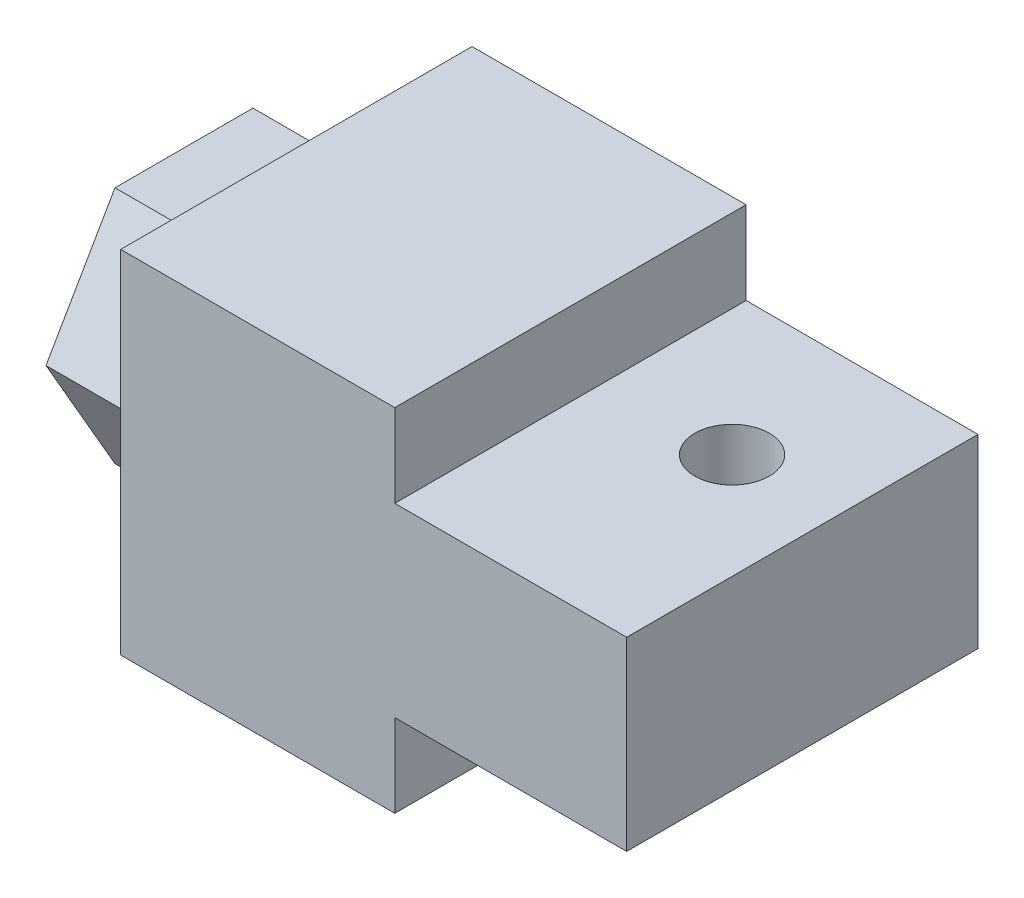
ISO-10303-21;
HEADER;
FILE_DESCRIPTION(('STEP AP214'),'2;1');
FILE_NAME('part.step','',(''),(''),'','','');
FILE_SCHEMA(('AUTOMOTIVE_DESIGN { 1 0 10303 214 1 1 1 1 }'));
ENDSEC;
DATA;
#1=APPLICATION_CONTEXT('core data for automotive mechanical design processes');
#2=APPLICATION_PROTOCOL_DEFINITION('international standard','automotive_design',2000,#1);
#3=PRODUCT_CONTEXT('',#1,'mechanical');
#4=PRODUCT('Part','Part','',(#3));
#5=PRODUCT_RELATED_PRODUCT_CATEGORY('part','',(#4));
#6=PRODUCT_DEFINITION_FORMATION('','',#4);
#7=PRODUCT_DEFINITION_CONTEXT('part definition',#1,'design');
#8=PRODUCT_DEFINITION('design','',#6,#7);
#9=PRODUCT_DEFINITION_SHAPE('','',#8);
#10=(LENGTH_UNIT() NAMED_UNIT(*) SI_UNIT(.MILLI.,.METRE.));
#11=(NAMED_UNIT(*) PLANE_ANGLE_UNIT() SI_UNIT($,.RADIAN.));
#12=(NAMED_UNIT(*) SI_UNIT($,.STERADIAN.) SOLID_ANGLE_UNIT());
#13=UNCERTAINTY_MEASURE_WITH_UNIT(LENGTH_MEASURE(1.E-05),#10,'distance_accuracy_value','');
#14=(GEOMETRIC_REPRESENTATION_CONTEXT(3) GLOBAL_UNCERTAINTY_ASSIGNED_CONTEXT((#13)) GLOBAL_UNIT_ASSIGNED_CONTEXT((#10,
#11,#12)) REPRESENTATION_CONTEXT('',''));
#15=CARTESIAN_POINT('',(0.,0.,0.));
#16=DIRECTION('',(0.,0.,1.));
#17=DIRECTION('',(1.,0.,0.));
#18=AXIS2_PLACEMENT_3D('',#15,#16,#17);
#19=CARTESIAN_POINT('',(36.,12.5,12.5));
#20=DIRECTION('',(0.,1.,0.));
#21=DIRECTION('',(0.,0.,-1.));
#22=AXIS2_PLACEMENT_3D('',#19,#20,#21);
#23=PLANE('',#22);
#24=DIRECTION('',(-1.,0.,0.));
#25=VECTOR('',#24,1.);
#26=CARTESIAN_POINT('',(36.,12.5,12.5));
#27=LINE('',#26,#25);
#28=CARTESIAN_POINT('',(19.5,12.5,12.5));
#29=VERTEX_POINT('',#28);
#30=CARTESIAN_POINT('',(0.,12.5,12.5));
#31=VERTEX_POINT('',#30);
#32=EDGE_CURVE('E23',#29,#31,#27,.T.);
#33=ORIENTED_EDGE('',*,*,#32,.F.);
#34=DIRECTION('',(0.,0.,-1.));
#35=VECTOR('',#34,1.);
#36=CARTESIAN_POINT('',(19.5,12.5,12.5));
#37=LINE('',#36,#35);
#38=CARTESIAN_POINT('',(19.5,12.5,-12.5));
#39=VERTEX_POINT('',#38);
#40=EDGE_CURVE('E193',#29,#39,#37,.T.);
#41=ORIENTED_EDGE('',*,*,#40,.T.);
#42=DIRECTION('',(-1.,0.,0.));
#43=VECTOR('',#42,1.);
#44=CARTESIAN_POINT('',(36.,12.5,-12.5));
#45=LINE('',#44,#43);
#46=CARTESIAN_POINT('',(0.,12.5,-12.5));
#47=VERTEX_POINT('',#46);
#48=EDGE_CURVE('E227',#39,#47,#45,.T.);
#49=ORIENTED_EDGE('',*,*,#48,.T.);
#50=DIRECTION('',(0.,0.,-1.));
#51=VECTOR('',#50,1.);
#52=CARTESIAN_POINT('',(0.,12.5,12.5));
#53=LINE('',#52,#51);
#54=EDGE_CURVE('E210',#31,#47,#53,.T.);
#55=ORIENTED_EDGE('',*,*,#54,.F.);
#56=EDGE_LOOP('',(#33,#41,#49,#55));
#57=FACE_BOUND('',#56,.T.);
#58=ADVANCED_FACE('F14',(#57),#23,.T.);
#59=CARTESIAN_POINT('',(36.,12.5,12.5));
#60=DIRECTION('',(0.,0.,-1.));
#61=DIRECTION('',(0.,-1.,0.));
#62=AXIS2_PLACEMENT_3D('',#59,#60,#61);
#63=PLANE('',#62);
#64=DIRECTION('',(0.,1.,0.));
#65=VECTOR('',#64,1.);
#66=CARTESIAN_POINT('',(19.5,6.6,12.5));
#67=LINE('',#66,#65);
#68=CARTESIAN_POINT('',(19.5,6.6,12.5));
#69=VERTEX_POINT('',#68);
#70=EDGE_CURVE('E181',#69,#29,#67,.T.);
#71=ORIENTED_EDGE('',*,*,#70,.T.);
#72=ORIENTED_EDGE('',*,*,#32,.T.);
#73=DIRECTION('',(0.,-1.,0.));
#74=VECTOR('',#73,1.);
#75=CARTESIAN_POINT('',(0.,12.5,12.5));
#76=LINE('',#75,#74);
#77=CARTESIAN_POINT('',(0.,-12.5,12.5));
#78=VERTEX_POINT('',#77);
#79=EDGE_CURVE('E219',#31,#78,#76,.T.);
#80=ORIENTED_EDGE('',*,*,#79,.T.);
#81=DIRECTION('',(-1.,0.,0.));
#82=VECTOR('',#81,1.);
#83=CARTESIAN_POINT('',(36.,-12.5,12.5));
#84=LINE('',#83,#82);
#85=CARTESIAN_POINT('',(19.5,-12.5,12.5));
#86=VERTEX_POINT('',#85);
#87=EDGE_CURVE('E231',#86,#78,#84,.T.);
#88=ORIENTED_EDGE('',*,*,#87,.F.);
#89=DIRECTION('',(0.,-1.,0.));
#90=VECTOR('',#89,1.);
#91=CARTESIAN_POINT('',(19.5,-6.6,12.5));
#92=LINE('',#91,#90);
#93=CARTESIAN_POINT('',(19.5,-6.6,12.5));
#94=VERTEX_POINT('',#93);
#95=EDGE_CURVE('E196',#94,#86,#92,.T.);
#96=ORIENTED_EDGE('',*,*,#95,.F.);
#97=DIRECTION('',(1.,0.,0.));
#98=VECTOR('',#97,1.);
#99=CARTESIAN_POINT('',(19.5,-6.6,12.5));
#100=LINE('',#99,#98);
#101=CARTESIAN_POINT('',(36.,-6.6,12.5));
#102=VERTEX_POINT('',#101);
#103=EDGE_CURVE('E198',#94,#102,#100,.T.);
#104=ORIENTED_EDGE('',*,*,#103,.T.);
#105=DIRECTION('',(0.,-1.,0.));
#106=VECTOR('',#105,1.);
#107=CARTESIAN_POINT('',(36.,12.5,12.5));
#108=LINE('',#107,#106);
#109=CARTESIAN_POINT('',(36.,6.6,12.5));
#110=VERTEX_POINT('',#109);
#111=EDGE_CURVE('E225',#110,#102,#108,.T.);
#112=ORIENTED_EDGE('',*,*,#111,.F.);
#113=DIRECTION('',(1.,0.,0.));
#114=VECTOR('',#113,1.);
#115=CARTESIAN_POINT('',(19.5,6.6,12.5));
#116=LINE('',#115,#114);
#117=EDGE_CURVE('E184',#69,#110,#116,.T.);
#118=ORIENTED_EDGE('',*,*,#117,.F.);
#119=EDGE_LOOP('',(#71,#72,#80,#88,#96,#104,#112,#118));
#120=FACE_BOUND('',#119,.T.);
#121=ADVANCED_FACE('F16',(#120),#63,.F.);
#122=CARTESIAN_POINT('',(36.,-12.5,-12.5));
#123=DIRECTION('',(0.,0.,1.));
#124=DIRECTION('',(0.,1.,0.));
#125=AXIS2_PLACEMENT_3D('',#122,#123,#124);
#126=PLANE('',#125);
#127=DIRECTION('',(0.,1.,0.));
#128=VECTOR('',#127,1.);
#129=CARTESIAN_POINT('',(19.5,6.6,-12.5));
#130=LINE('',#129,#128);
#131=CARTESIAN_POINT('',(19.5,6.6,-12.5));
#132=VERTEX_POINT('',#131);
#133=EDGE_CURVE('E186',#132,#39,#130,.T.);
#134=ORIENTED_EDGE('',*,*,#133,.F.);
#135=DIRECTION('',(1.,0.,0.));
#136=VECTOR('',#135,1.);
#137=CARTESIAN_POINT('',(19.5,6.6,-12.5));
#138=LINE('',#137,#136);
#139=CARTESIAN_POINT('',(36.,6.6,-12.5));
#140=VERTEX_POINT('',#139);
#141=EDGE_CURVE('E188',#132,#140,#138,.T.);
#142=ORIENTED_EDGE('',*,*,#141,.T.);
#143=DIRECTION('',(0.,1.,0.));
#144=VECTOR('',#143,1.);
#145=CARTESIAN_POINT('',(36.,-12.5,-12.5));
#146=LINE('',#145,#144);
#147=CARTESIAN_POINT('',(36.,-6.6,-12.5));
#148=VERTEX_POINT('',#147);
#149=EDGE_CURVE('E222',#148,#140,#146,.T.);
#150=ORIENTED_EDGE('',*,*,#149,.F.);
#151=DIRECTION('',(1.,0.,0.));
#152=VECTOR('',#151,1.);
#153=CARTESIAN_POINT('',(19.5,-6.6,-12.5));
#154=LINE('',#153,#152);
#155=CARTESIAN_POINT('',(19.5,-6.6,-12.5));
#156=VERTEX_POINT('',#155);
#157=EDGE_CURVE('E204',#156,#148,#154,.T.);
#158=ORIENTED_EDGE('',*,*,#157,.F.);
#159=DIRECTION('',(0.,-1.,0.));
#160=VECTOR('',#159,1.);
#161=CARTESIAN_POINT('',(19.5,-6.6,-12.5));
#162=LINE('',#161,#160);
#163=CARTESIAN_POINT('',(19.5,-12.5,-12.5));
#164=VERTEX_POINT('',#163);
#165=EDGE_CURVE('E201',#156,#164,#162,.T.);
#166=ORIENTED_EDGE('',*,*,#165,.T.);
#167=DIRECTION('',(-1.,0.,0.));
#168=VECTOR('',#167,1.);
#169=CARTESIAN_POINT('',(36.,-12.5,-12.5));
#170=LINE('',#169,#168);
#171=CARTESIAN_POINT('',(0.,-12.5,-12.5));
#172=VERTEX_POINT('',#171);
#173=EDGE_CURVE('E229',#164,#172,#170,.T.);
#174=ORIENTED_EDGE('',*,*,#173,.T.);
#175=DIRECTION('',(0.,1.,0.));
#176=VECTOR('',#175,1.);
#177=CARTESIAN_POINT('',(0.,-12.5,-12.5));
#178=LINE('',#177,#176);
#179=EDGE_CURVE('E213',#172,#47,#178,.T.);
#180=ORIENTED_EDGE('',*,*,#179,.T.);
#181=ORIENTED_EDGE('',*,*,#48,.F.);
#182=EDGE_LOOP('',(#134,#142,#150,#158,#166,#174,#180,#181));
#183=FACE_BOUND('',#182,.T.);
#184=ADVANCED_FACE('F263',(#183),#126,.F.);
#185=CARTESIAN_POINT('',(36.,12.5,-12.5));
#186=DIRECTION('',(1.,0.,0.));
#187=DIRECTION('',(0.,1.,0.));
#188=AXIS2_PLACEMENT_3D('',#185,#186,#187);
#189=PLANE('',#188);
#190=DIRECTION('',(0.,0.,-1.));
#191=VECTOR('',#190,1.);
#192=CARTESIAN_POINT('',(36.,6.6,-12.5));
#193=LINE('',#192,#191);
#194=EDGE_CURVE('E38',#110,#140,#193,.T.);
#195=ORIENTED_EDGE('',*,*,#194,.F.);
#196=ORIENTED_EDGE('',*,*,#111,.T.);
#197=DIRECTION('',(0.,0.,-1.));
#198=VECTOR('',#197,1.);
#199=CARTESIAN_POINT('',(36.,-6.6,-12.5));
#200=LINE('',#199,#198);
#201=EDGE_CURVE('E9',#102,#148,#200,.T.);
#202=ORIENTED_EDGE('',*,*,#201,.T.);
#203=ORIENTED_EDGE('',*,*,#149,.T.);
#204=EDGE_LOOP('',(#195,#196,#202,#203));
#205=FACE_BOUND('',#204,.T.);
#206=ADVANCED_FACE('F260',(#205),#189,.T.);
#207=CARTESIAN_POINT('',(36.,-12.5,-12.5));
#208=DIRECTION('',(0.,-1.,0.));
#209=DIRECTION('',(1.,0.,0.));
#210=AXIS2_PLACEMENT_3D('',#207,#208,#209);
#211=PLANE('',#210);
#212=DIRECTION('',(0.,0.,-1.));
#213=VECTOR('',#212,1.);
#214=CARTESIAN_POINT('',(19.5,-12.5,-12.5));
#215=LINE('',#214,#213);
#216=EDGE_CURVE('E208',#86,#164,#215,.T.);
#217=ORIENTED_EDGE('',*,*,#216,.F.);
#218=ORIENTED_EDGE('',*,*,#87,.T.);
#219=DIRECTION('',(0.,0.,1.));
#220=VECTOR('',#219,1.);
#221=CARTESIAN_POINT('',(0.,-12.5,-12.5));
#222=LINE('',#221,#220);
#223=EDGE_CURVE('E216',#172,#78,#222,.T.);
#224=ORIENTED_EDGE('',*,*,#223,.F.);
#225=ORIENTED_EDGE('',*,*,#173,.F.);
#226=EDGE_LOOP('',(#217,#218,#224,#225));
#227=FACE_BOUND('',#226,.T.);
#228=ADVANCED_FACE('F247',(#227),#211,.T.);
#229=CARTESIAN_POINT('',(0.,12.5,-12.5));
#230=DIRECTION('',(1.,0.,0.));
#231=DIRECTION('',(0.,1.,0.));
#232=AXIS2_PLACEMENT_3D('',#229,#230,#231);
#233=PLANE('',#232);
#234=DIRECTION('',(0.,0.,-1.));
#235=VECTOR('',#234,1.);
#236=CARTESIAN_POINT('',(0.,-8.5,4.90747728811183));
#237=LINE('',#236,#235);
#238=CARTESIAN_POINT('',(0.,-8.5,4.90747728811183));
#239=VERTEX_POINT('',#238);
#240=CARTESIAN_POINT('',(0.,-8.5,-4.90747728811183));
#241=VERTEX_POINT('',#240);
#242=EDGE_CURVE('E139',#239,#241,#237,.T.);
#243=ORIENTED_EDGE('',*,*,#242,.T.);
#244=DIRECTION('',(0.,0.866025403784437,-0.5));
#245=VECTOR('',#244,1.);
#246=CARTESIAN_POINT('',(0.,-8.5,-4.90747728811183));
#247=LINE('',#246,#245);
#248=CARTESIAN_POINT('',(0.,0.,-9.8149545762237));
#249=VERTEX_POINT('',#248);
#250=EDGE_CURVE('E30',#241,#249,#247,.T.);
#251=ORIENTED_EDGE('',*,*,#250,.T.);
#252=DIRECTION('',(0.,-0.866025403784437,-0.5));
#253=VECTOR('',#252,1.);
#254=CARTESIAN_POINT('',(0.,8.5,-4.90747728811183));
#255=LINE('',#254,#253);
#256=CARTESIAN_POINT('',(0.,8.5,-4.90747728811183));
#257=VERTEX_POINT('',#256);
#258=EDGE_CURVE('E127',#257,#249,#255,.T.);
#259=ORIENTED_EDGE('',*,*,#258,.F.);
#260=DIRECTION('',(0.,0.,-1.));
#261=VECTOR('',#260,1.);
#262=CARTESIAN_POINT('',(0.,8.5,4.90747728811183));
#263=LINE('',#262,#261);
#264=CARTESIAN_POINT('',(0.,8.5,4.90747728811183));
#265=VERTEX_POINT('',#264);
#266=EDGE_CURVE('E132',#265,#257,#263,.T.);
#267=ORIENTED_EDGE('',*,*,#266,.F.);
#268=DIRECTION('',(0.,-0.866025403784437,0.5));
#269=VECTOR('',#268,1.);
#270=CARTESIAN_POINT('',(0.,8.5,4.90747728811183));
#271=LINE('',#270,#269);
#272=CARTESIAN_POINT('',(0.,0.,9.8149545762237));
#273=VERTEX_POINT('',#272);
#274=EDGE_CURVE('E148',#265,#273,#271,.T.);
#275=ORIENTED_EDGE('',*,*,#274,.T.);
#276=DIRECTION('',(0.,0.866025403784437,0.5));
#277=VECTOR('',#276,1.);
#278=CARTESIAN_POINT('',(0.,-8.5,4.90747728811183));
#279=LINE('',#278,#277);
#280=EDGE_CURVE('E151',#239,#273,#279,.T.);
#281=ORIENTED_EDGE('',*,*,#280,.F.);
#282=EDGE_LOOP('',(#243,#251,#259,#267,#275,#281));
#283=FACE_BOUND('',#282,.T.);
#284=ORIENTED_EDGE('',*,*,#54,.T.);
#285=ORIENTED_EDGE('',*,*,#179,.F.);
#286=ORIENTED_EDGE('',*,*,#223,.T.);
#287=ORIENTED_EDGE('',*,*,#79,.F.);
#288=EDGE_LOOP('',(#284,#285,#286,#287));
#289=FACE_BOUND('',#288,.T.);
#290=ADVANCED_FACE('F135',(#283,#289),#233,.F.);
#291=CARTESIAN_POINT('',(19.5,-6.6,-12.5));
#292=DIRECTION('',(-1.,0.,0.));
#293=DIRECTION('',(0.,-1.,0.));
#294=AXIS2_PLACEMENT_3D('',#291,#292,#293);
#295=PLANE('',#294);
#296=ORIENTED_EDGE('',*,*,#216,.T.);
#297=ORIENTED_EDGE('',*,*,#165,.F.);
#298=DIRECTION('',(0.,0.,1.));
#299=VECTOR('',#298,1.);
#300=CARTESIAN_POINT('',(19.5,-6.6,-12.5));
#301=LINE('',#300,#299);
#302=EDGE_CURVE('E206',#156,#94,#301,.T.);
#303=ORIENTED_EDGE('',*,*,#302,.T.);
#304=ORIENTED_EDGE('',*,*,#95,.T.);
#305=EDGE_LOOP('',(#296,#297,#303,#304));
#306=FACE_BOUND('',#305,.T.);
#307=ADVANCED_FACE('F252',(#306),#295,.F.);
#308=CARTESIAN_POINT('',(19.5,-6.6,-12.5));
#309=DIRECTION('',(0.,-1.,0.));
#310=DIRECTION('',(1.,0.,0.));
#311=AXIS2_PLACEMENT_3D('',#308,#309,#310);
#312=PLANE('',#311);
#313=CARTESIAN_POINT('',(28.5,-6.6,-2.5));
#314=DIRECTION('',(0.,-1.,0.));
#315=DIRECTION('',(1.,0.,0.));
#316=AXIS2_PLACEMENT_3D('',#313,#314,#315);
#317=CIRCLE('',#316,2.65);
#318=CARTESIAN_POINT('',(31.15,-6.6,-2.5));
#319=VERTEX_POINT('',#318);
#320=EDGE_CURVE('E178',#319,#319,#317,.T.);
#321=ORIENTED_EDGE('',*,*,#320,.F.);
#322=EDGE_LOOP('',(#321));
#323=FACE_BOUND('',#322,.T.);
#324=ORIENTED_EDGE('',*,*,#103,.F.);
#325=ORIENTED_EDGE('',*,*,#302,.F.);
#326=ORIENTED_EDGE('',*,*,#157,.T.);
#327=ORIENTED_EDGE('',*,*,#201,.F.);
#328=EDGE_LOOP('',(#324,#325,#326,#327));
#329=FACE_BOUND('',#328,.T.);
#330=ADVANCED_FACE('F257',(#323,#329),#312,.T.);
#331=CARTESIAN_POINT('',(19.5,6.6,-12.5));
#332=DIRECTION('',(1.,0.,0.));
#333=DIRECTION('',(0.,1.,0.));
#334=AXIS2_PLACEMENT_3D('',#331,#332,#333);
#335=PLANE('',#334);
#336=ORIENTED_EDGE('',*,*,#70,.F.);
#337=DIRECTION('',(0.,0.,1.));
#338=VECTOR('',#337,1.);
#339=CARTESIAN_POINT('',(19.5,6.6,-12.5));
#340=LINE('',#339,#338);
#341=EDGE_CURVE('E190',#132,#69,#340,.T.);
#342=ORIENTED_EDGE('',*,*,#341,.F.);
#343=ORIENTED_EDGE('',*,*,#133,.T.);
#344=ORIENTED_EDGE('',*,*,#40,.F.);
#345=EDGE_LOOP('',(#336,#342,#343,#344));
#346=FACE_BOUND('',#345,.T.);
#347=ADVANCED_FACE('F266',(#346),#335,.T.);
#348=CARTESIAN_POINT('',(19.5,6.6,-12.5));
#349=DIRECTION('',(0.,-1.,0.));
#350=DIRECTION('',(1.,0.,0.));
#351=AXIS2_PLACEMENT_3D('',#348,#349,#350);
#352=PLANE('',#351);
#353=CARTESIAN_POINT('',(28.5,6.6,-2.5));
#354=DIRECTION('',(0.,-1.,0.));
#355=DIRECTION('',(1.,0.,0.));
#356=AXIS2_PLACEMENT_3D('',#353,#354,#355);
#357=CIRCLE('',#356,2.65);
#358=CARTESIAN_POINT('',(31.15,6.6,-2.5));
#359=VERTEX_POINT('',#358);
#360=EDGE_CURVE('E18',#359,#359,#357,.T.);
#361=ORIENTED_EDGE('',*,*,#360,.T.);
#362=EDGE_LOOP('',(#361));
#363=FACE_BOUND('',#362,.T.);
#364=ORIENTED_EDGE('',*,*,#194,.T.);
#365=ORIENTED_EDGE('',*,*,#141,.F.);
#366=ORIENTED_EDGE('',*,*,#341,.T.);
#367=ORIENTED_EDGE('',*,*,#117,.T.);
#368=EDGE_LOOP('',(#364,#365,#366,#367));
#369=FACE_BOUND('',#368,.T.);
#370=ADVANCED_FACE('F264',(#363,#369),#352,.F.);
#371=CARTESIAN_POINT('',(28.5,12.5,-2.5));
#372=DIRECTION('',(0.,-1.,0.));
#373=DIRECTION('',(1.,0.,0.));
#374=AXIS2_PLACEMENT_3D('',#371,#372,#373);
#375=CYLINDRICAL_SURFACE('',#374,2.65);
#376=ORIENTED_EDGE('',*,*,#320,.T.);
#377=EDGE_LOOP('',(#376));
#378=FACE_BOUND('',#377,.T.);
#379=ORIENTED_EDGE('',*,*,#360,.F.);
#380=EDGE_LOOP('',(#379));
#381=FACE_BOUND('',#380,.T.);
#382=ADVANCED_FACE('F275',(#378,#381),#375,.F.);
#383=CARTESIAN_POINT('',(-8.,-8.5,-4.90747728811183));
#384=DIRECTION('',(0.,-0.5,-0.866025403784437));
#385=DIRECTION('',(0.,-0.866025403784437,0.5));
#386=AXIS2_PLACEMENT_3D('',#383,#384,#385);
#387=PLANE('',#386);
#388=DIRECTION('',(1.,0.,0.));
#389=VECTOR('',#388,1.);
#390=CARTESIAN_POINT('',(-8.,-8.5,-4.90747728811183));
#391=LINE('',#390,#389);
#392=CARTESIAN_POINT('',(-8.,-8.5,-4.90747728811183));
#393=VERTEX_POINT('',#392);
#394=EDGE_CURVE('E176',#393,#241,#391,.T.);
#395=ORIENTED_EDGE('',*,*,#394,.F.);
#396=DIRECTION('',(0.,0.866025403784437,-0.5));
#397=VECTOR('',#396,1.);
#398=CARTESIAN_POINT('',(-8.,-8.5,-4.90747728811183));
#399=LINE('',#398,#397);
#400=CARTESIAN_POINT('',(-8.,0.,-9.8149545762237));
#401=VERTEX_POINT('',#400);
#402=EDGE_CURVE('E119',#393,#401,#399,.T.);
#403=ORIENTED_EDGE('',*,*,#402,.T.);
#404=DIRECTION('',(1.,0.,0.));
#405=VECTOR('',#404,1.);
#406=CARTESIAN_POINT('',(-8.,0.,-9.8149545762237));
#407=LINE('',#406,#405);
#408=EDGE_CURVE('E115',#401,#249,#407,.T.);
#409=ORIENTED_EDGE('',*,*,#408,.T.);
#410=ORIENTED_EDGE('',*,*,#250,.F.);
#411=EDGE_LOOP('',(#395,#403,#409,#410));
#412=FACE_BOUND('',#411,.T.);
#413=ADVANCED_FACE('F117',(#412),#387,.T.);
#414=CARTESIAN_POINT('',(-8.,-8.5,4.90747728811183));
#415=DIRECTION('',(0.,-1.,0.));
#416=DIRECTION('',(1.,0.,0.));
#417=AXIS2_PLACEMENT_3D('',#414,#415,#416);
#418=PLANE('',#417);
#419=DIRECTION('',(1.,0.,0.));
#420=VECTOR('',#419,1.);
#421=CARTESIAN_POINT('',(-8.,-8.5,4.90747728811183));
#422=LINE('',#421,#420);
#423=CARTESIAN_POINT('',(-8.,-8.5,4.90747728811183));
#424=VERTEX_POINT('',#423);
#425=EDGE_CURVE('E174',#424,#239,#422,.T.);
#426=ORIENTED_EDGE('',*,*,#425,.F.);
#427=DIRECTION('',(0.,0.,-1.));
#428=VECTOR('',#427,1.);
#429=CARTESIAN_POINT('',(-8.,-8.5,4.90747728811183));
#430=LINE('',#429,#428);
#431=EDGE_CURVE('E124',#424,#393,#430,.T.);
#432=ORIENTED_EDGE('',*,*,#431,.T.);
#433=ORIENTED_EDGE('',*,*,#394,.T.);
#434=ORIENTED_EDGE('',*,*,#242,.F.);
#435=EDGE_LOOP('',(#426,#432,#433,#434));
#436=FACE_BOUND('',#435,.T.);
#437=ADVANCED_FACE('F354',(#436),#418,.T.);
#438=CARTESIAN_POINT('',(-8.,-8.5,4.90747728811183));
#439=DIRECTION('',(0.,0.5,-0.866025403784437));
#440=DIRECTION('',(0.,-0.866025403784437,-0.5));
#441=AXIS2_PLACEMENT_3D('',#438,#439,#440);
#442=PLANE('',#441);
#443=DIRECTION('',(1.,0.,0.));
#444=VECTOR('',#443,1.);
#445=CARTESIAN_POINT('',(-8.,0.,9.8149545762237));
#446=LINE('',#445,#444);
#447=CARTESIAN_POINT('',(-8.,0.,9.8149545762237));
#448=VERTEX_POINT('',#447);
#449=EDGE_CURVE('E172',#448,#273,#446,.T.);
#450=ORIENTED_EDGE('',*,*,#449,.F.);
#451=DIRECTION('',(0.,0.866025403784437,0.5));
#452=VECTOR('',#451,1.);
#453=CARTESIAN_POINT('',(-8.,-8.5,4.90747728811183));
#454=LINE('',#453,#452);
#455=EDGE_CURVE('E164',#424,#448,#454,.T.);
#456=ORIENTED_EDGE('',*,*,#455,.F.);
#457=ORIENTED_EDGE('',*,*,#425,.T.);
#458=ORIENTED_EDGE('',*,*,#280,.T.);
#459=EDGE_LOOP('',(#450,#456,#457,#458));
#460=FACE_BOUND('',#459,.T.);
#461=ADVANCED_FACE('F362',(#460),#442,.F.);
#462=CARTESIAN_POINT('',(-8.,8.5,4.90747728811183));
#463=DIRECTION('',(0.,0.5,0.866025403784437));
#464=DIRECTION('',(0.,0.866025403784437,-0.5));
#465=AXIS2_PLACEMENT_3D('',#462,#463,#464);
#466=PLANE('',#465);
#467=DIRECTION('',(1.,0.,0.));
#468=VECTOR('',#467,1.);
#469=CARTESIAN_POINT('',(-8.,8.5,4.90747728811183));
#470=LINE('',#469,#468);
#471=CARTESIAN_POINT('',(-8.,8.5,4.90747728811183));
#472=VERTEX_POINT('',#471);
#473=EDGE_CURVE('E170',#472,#265,#470,.T.);
#474=ORIENTED_EDGE('',*,*,#473,.F.);
#475=DIRECTION('',(0.,-0.866025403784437,0.5));
#476=VECTOR('',#475,1.);
#477=CARTESIAN_POINT('',(-8.,8.5,4.90747728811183));
#478=LINE('',#477,#476);
#479=EDGE_CURVE('E161',#472,#448,#478,.T.);
#480=ORIENTED_EDGE('',*,*,#479,.T.);
#481=ORIENTED_EDGE('',*,*,#449,.T.);
#482=ORIENTED_EDGE('',*,*,#274,.F.);
#483=EDGE_LOOP('',(#474,#480,#481,#482));
#484=FACE_BOUND('',#483,.T.);
#485=ADVANCED_FACE('F371',(#484),#466,.T.);
#486=CARTESIAN_POINT('',(-8.,8.5,4.90747728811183));
#487=DIRECTION('',(0.,-1.,0.));
#488=DIRECTION('',(1.,0.,0.));
#489=AXIS2_PLACEMENT_3D('',#486,#487,#488);
#490=PLANE('',#489);
#491=DIRECTION('',(1.,0.,0.));
#492=VECTOR('',#491,1.);
#493=CARTESIAN_POINT('',(-8.,8.5,-4.90747728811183));
#494=LINE('',#493,#492);
#495=CARTESIAN_POINT('',(-8.,8.5,-4.90747728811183));
#496=VERTEX_POINT('',#495);
#497=EDGE_CURVE('E123',#496,#257,#494,.T.);
#498=ORIENTED_EDGE('',*,*,#497,.F.);
#499=DIRECTION('',(0.,0.,-1.));
#500=VECTOR('',#499,1.);
#501=CARTESIAN_POINT('',(-8.,8.5,4.90747728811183));
#502=LINE('',#501,#500);
#503=EDGE_CURVE('E158',#472,#496,#502,.T.);
#504=ORIENTED_EDGE('',*,*,#503,.F.);
#505=ORIENTED_EDGE('',*,*,#473,.T.);
#506=ORIENTED_EDGE('',*,*,#266,.T.);
#507=EDGE_LOOP('',(#498,#504,#505,#506));
#508=FACE_BOUND('',#507,.T.);
#509=ADVANCED_FACE('F380',(#508),#490,.F.);
#510=CARTESIAN_POINT('',(-8.,8.5,-4.90747728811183));
#511=DIRECTION('',(0.,-0.5,0.866025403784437));
#512=DIRECTION('',(0.,0.866025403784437,0.5));
#513=AXIS2_PLACEMENT_3D('',#510,#511,#512);
#514=PLANE('',#513);
#515=DIRECTION('',(0.,-0.866025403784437,-0.5));
#516=VECTOR('',#515,1.);
#517=CARTESIAN_POINT('',(-8.,8.5,-4.90747728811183));
#518=LINE('',#517,#516);
#519=EDGE_CURVE('E156',#496,#401,#518,.T.);
#520=ORIENTED_EDGE('',*,*,#519,.F.);
#521=ORIENTED_EDGE('',*,*,#497,.T.);
#522=ORIENTED_EDGE('',*,*,#258,.T.);
#523=ORIENTED_EDGE('',*,*,#408,.F.);
#524=EDGE_LOOP('',(#520,#521,#522,#523));
#525=FACE_BOUND('',#524,.T.);
#526=ADVANCED_FACE('F128',(#525),#514,.F.);
#527=CARTESIAN_POINT('',(-8.,0.,-9.81495457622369));
#528=DIRECTION('',(-1.,0.,0.));
#529=DIRECTION('',(0.,-1.,0.));
#530=AXIS2_PLACEMENT_3D('',#527,#528,#529);
#531=PLANE('',#530);
#532=CARTESIAN_POINT('',(-8.,0.,0.));
#533=DIRECTION('',(-1.,0.,0.));
#534=DIRECTION('',(0.,-1.,0.));
#535=AXIS2_PLACEMENT_3D('',#532,#533,#534);
#536=CIRCLE('',#535,5.);
#537=CARTESIAN_POINT('',(-8.,-5.,0.));
#538=VERTEX_POINT('',#537);
#539=EDGE_CURVE('E140',#538,#538,#536,.T.);
#540=ORIENTED_EDGE('',*,*,#539,.F.);
#541=EDGE_LOOP('',(#540));
#542=FACE_BOUND('',#541,.T.);
#543=ORIENTED_EDGE('',*,*,#402,.F.);
#544=ORIENTED_EDGE('',*,*,#431,.F.);
#545=ORIENTED_EDGE('',*,*,#455,.T.);
#546=ORIENTED_EDGE('',*,*,#479,.F.);
#547=ORIENTED_EDGE('',*,*,#503,.T.);
#548=ORIENTED_EDGE('',*,*,#519,.T.);
#549=EDGE_LOOP('',(#543,#544,#545,#546,#547,#548));
#550=FACE_BOUND('',#549,.T.);
#551=ADVANCED_FACE('F391',(#542,#550),#531,.T.);
#552=CARTESIAN_POINT('',(12.,0.,0.));
#553=DIRECTION('',(-1.,0.,0.));
#554=DIRECTION('',(0.,-1.,0.));
#555=AXIS2_PLACEMENT_3D('',#552,#553,#554);
#556=CYLINDRICAL_SURFACE('',#555,5.);
#557=ORIENTED_EDGE('',*,*,#539,.T.);
#558=EDGE_LOOP('',(#557));
#559=FACE_BOUND('',#558,.T.);
#560=CARTESIAN_POINT('',(15.,0.,0.));
#561=DIRECTION('',(-1.,0.,0.));
#562=DIRECTION('',(0.,-1.,0.));
#563=AXIS2_PLACEMENT_3D('',#560,#561,#562);
#564=CIRCLE('',#563,5.);
#565=CARTESIAN_POINT('',(15.,-5.,0.));
#566=VERTEX_POINT('',#565);
#567=EDGE_CURVE('E143',#566,#566,#564,.T.);
#568=ORIENTED_EDGE('',*,*,#567,.F.);
#569=EDGE_LOOP('',(#568));
#570=FACE_BOUND('',#569,.T.);
#571=ADVANCED_FACE('F399',(#559,#570),#556,.F.);
#572=CARTESIAN_POINT('',(15.,0.,0.));
#573=DIRECTION('',(-1.,0.,0.));
#574=DIRECTION('',(0.,-1.,0.));
#575=AXIS2_PLACEMENT_3D('',#572,#573,#574);
#576=PLANE('',#575);
#577=ORIENTED_EDGE('',*,*,#567,.T.);
#578=EDGE_LOOP('',(#577));
#579=FACE_BOUND('',#578,.T.);
#580=ADVANCED_FACE('F414',(#579),#576,.T.);
#581=CLOSED_SHELL('',(#58,#121,#184,#206,#228,#290,#307,#330,#347,#370,#382,#413,#437,#461,#485,
#509,#526,#551,#571,#580));
#582=MANIFOLD_SOLID_BREP('B1',#581);
#583=ADVANCED_BREP_SHAPE_REPRESENTATION('',(#18,#582),#14);
#584=SHAPE_DEFINITION_REPRESENTATION(#9,#583);
ENDSEC;
END-ISO-10303-21;
